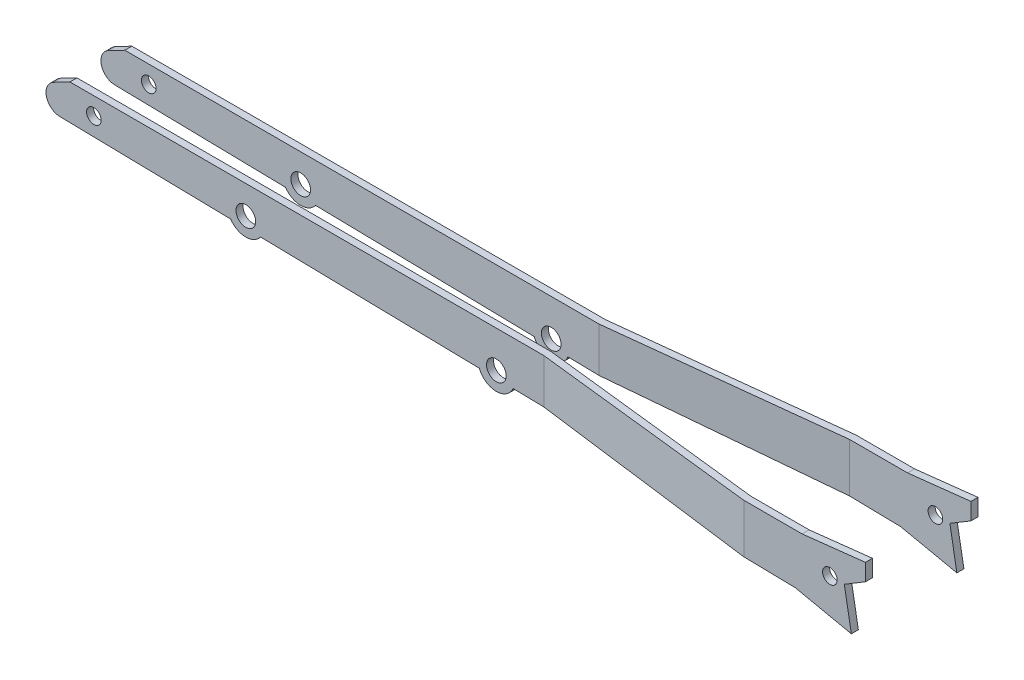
from build123d import *

# Parameters (mm, degrees)
ESQUISSE1_R                         = 2.6
ESQUISSE1_R_2                       = 3.5
BOSS_EXTRU_1_DEPTH                  = 2.5
BOSS_EXTRU_2_DEPTH                  = 22
ESQUISSE10_R                        = 2.6
BOSS_EXTRU_5_DEPTH                  = 2.5
ENL_V_MAT_EXTRU_6_REACH             = 285.802
ENL_V_MAT_EXTRU_6_DIRECTION_2_REACH = 285.802


with BuildPart() as part:
    # Esquisse1 → Boss.-Extru.1 (new body)
    with BuildSketch(Plane.XY):
        with BuildLine():
            Line((-8.5, 6.25), (160, 6.25))
            Line((160, 6.25), (160, -9.584269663))
            Line((160, -9.584269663), (148.94990339, -9.366992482))
            ThreePointArc((148.94990339, -9.366992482), (142.872215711, -13.248743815), (136.95182, -9.131075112))
            Line((136.95182, -9.131075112), (59.234968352, -7.602934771))
            ThreePointArc((59.234968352, -7.602934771), (53.872215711, -10.248743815), (48.617616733, -7.394166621))
            Line((48.617616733, -7.394166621), (-12.098295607, -6.200314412))
            ThreePointArc((-12.098295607, -6.200314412), (-16.868746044, -2.339398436), (-14.304163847, 3.236154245))
            Line((-14.304163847, 3.236154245), (-8.5, 6.25))
        make_face()
        Circle(ESQUISSE1_R, mode=Mode.SUBTRACT)
        with Locations((143, -6.75)):
            Circle(ESQUISSE1_R_2, mode=Mode.SUBTRACT)
        with Locations((54, -3.75)):
            Circle(ESQUISSE1_R_2, mode=Mode.SUBTRACT)
    extrude(amount=BOSS_EXTRU_1_DEPTH)

    # Esquisse2 → Boss.-Extru.2 (add)
    with BuildSketch(Plane(origin=(0, 6.25, 0), x_dir=(1, 0, 0), z_dir=(0, 1, 0))):
        Polygon((160, 0), (240, -9), (240, -11.51577057), (159.859817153, -2.5), align=None)
    extrude(amount=-BOSS_EXTRU_2_DEPTH)

    # Esquisse10 → Boss.-Extru.5 (add)
    with BuildSketch(Plane(origin=(0, 0, 11.5), x_dir=(-1, 0, 0), z_dir=(0, 0, -1))):
        Polygon((-240, 6.25), (-260.631253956, 6.25), (-283.131253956, 8.75), (-283.131253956, 2.75), (-275.631253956, -1.75), (-278.131253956, -15.75), (-240, -15.75), align=None)
        with Locations((-270.5, -1.75)):
            Circle(ESQUISSE10_R, mode=Mode.SUBTRACT)
    extrude(amount=BOSS_EXTRU_5_DEPTH)

    # Esquisse11 → Enl_v. mat.-Extru.6 (cut, up to next)
    with BuildSketch(Plane.XY.offset(11.5), mode=Mode.PRIVATE) as enl_v_mat_extru_6_sk1:
        Polygon((159.859817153, -9.581513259), (258.131253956, -11.513816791), (278.131253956, -15.75), (159.859817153, -15.75), align=None)
    enl_v_mat_extru_6_tool1 = extrude(enl_v_mat_extru_6_sk1.sketch, amount=-ENL_V_MAT_EXTRU_6_REACH, mode=Mode.PRIVATE) & part.part
    add(enl_v_mat_extru_6_tool1.solids().sort_by_distance((210.456557, -13.212207, 11.5))[0], mode=Mode.SUBTRACT)

    # Esquisse11 → Enl_v. mat.-Extru.6 direction 2 (cut, up to next)
    with BuildSketch(Plane.XY.offset(11.5), mode=Mode.PRIVATE) as enl_v_mat_extru_6_direction_2_sk1:
        Polygon((159.859817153, -9.581513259), (258.131253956, -11.513816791), (278.131253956, -15.75), (159.859817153, -15.75), align=None)
    enl_v_mat_extru_6_direction_2_tool1 = extrude(enl_v_mat_extru_6_direction_2_sk1.sketch, amount=ENL_V_MAT_EXTRU_6_DIRECTION_2_REACH, mode=Mode.PRIVATE) & part.part
    add(enl_v_mat_extru_6_direction_2_tool1.solids().sort_by_distance((210.456557, -13.212207, 11.5))[0], mode=Mode.SUBTRACT)


with BuildPart() as body_2:
    # Sym_trie2: mirrored copy
    add(part.part.mirror(Plane.XY.offset(-8.5)))


solid = Compound([part.part, body_2.part])
